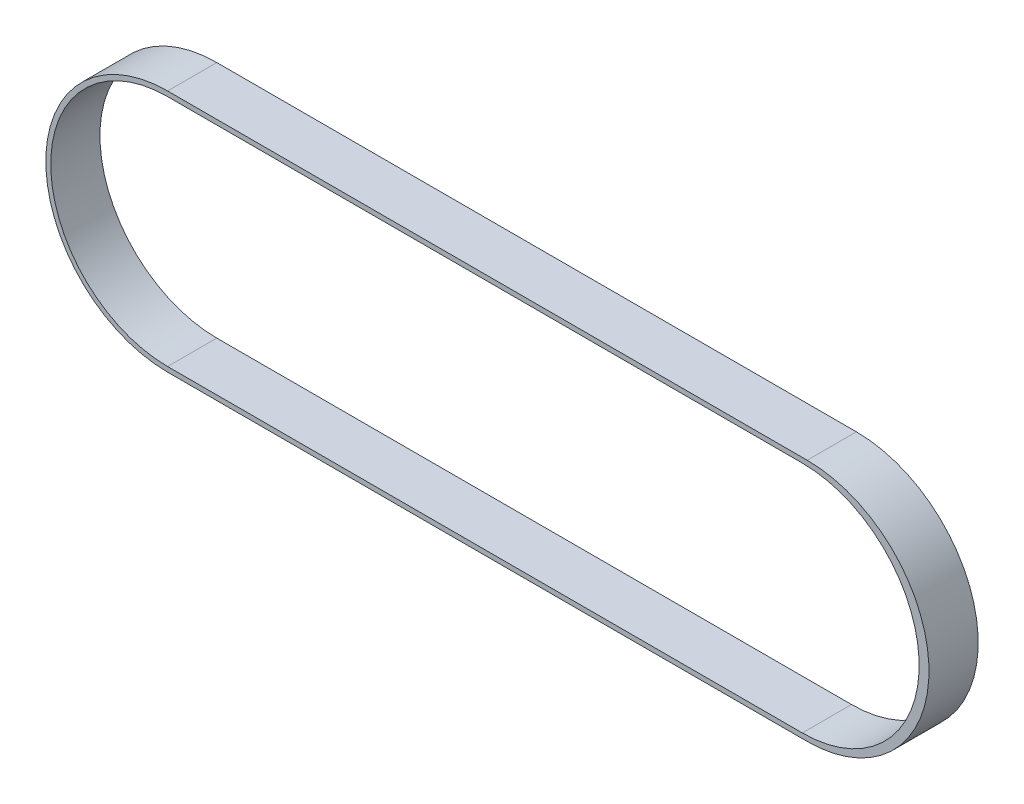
from build123d import *

# Parameters (mm, degrees)
BOSS_EXTRUDE1_DEPTH = 12.7
CUT_EXTRUDE1_DEPTH  = 200.434990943


with BuildPart() as part:
    # Sketch2 → Boss-Extrude1 (new body)
    with BuildSketch(Plane.XY):
        with BuildLine():
            Line((0, 31.4325), (165.1, 31.4325))
            ThreePointArc((165.1, 31.4325), (196.5325, 0), (165.1, -31.4325))
            Line((165.1, -31.4325), (0, -31.4325))
            ThreePointArc((0, -31.4325), (-31.4325, 0), (0, 31.4325))
        make_face()
    extrude(amount=BOSS_EXTRUDE1_DEPTH)

    # Sketch3 → Cut-Extrude1 (cut, through all)
    with BuildSketch(Plane.XY.offset(12.7)):
        with BuildLine():
            Line((0, 30.1625), (163.83, 30.1625))
            ThreePointArc((163.83, 30.1625), (193.9925, 0), (163.83, -30.1625))
            Line((163.83, -30.1625), (0, -30.1625))
            ThreePointArc((0, -30.1625), (-30.1625, 0), (0, 30.1625))
        make_face()
    extrude(amount=-CUT_EXTRUDE1_DEPTH, mode=Mode.SUBTRACT)


solid = part.part
